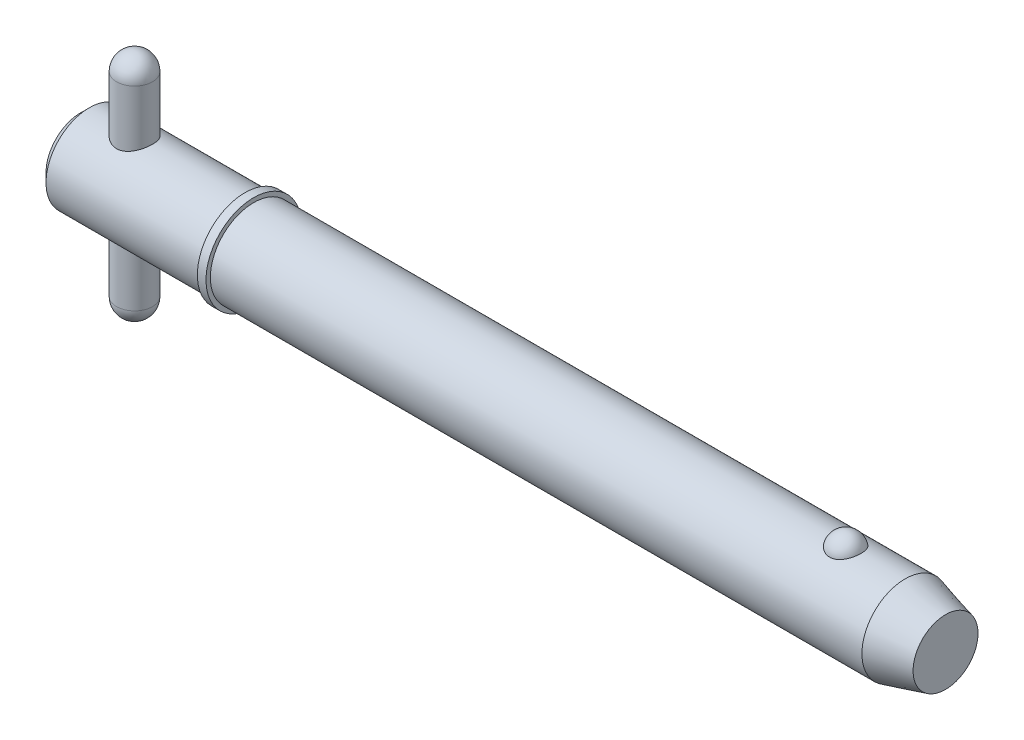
ISO-10303-21;
HEADER;
FILE_DESCRIPTION(('STEP AP214'),'2;1');
FILE_NAME('part.step','',(''),(''),'','','');
FILE_SCHEMA(('AUTOMOTIVE_DESIGN { 1 0 10303 214 1 1 1 1 }'));
ENDSEC;
DATA;
#1=APPLICATION_CONTEXT('core data for automotive mechanical design processes');
#2=APPLICATION_PROTOCOL_DEFINITION('international standard','automotive_design',2000,#1);
#3=PRODUCT_CONTEXT('',#1,'mechanical');
#4=PRODUCT('Part','Part','',(#3));
#5=PRODUCT_RELATED_PRODUCT_CATEGORY('part','',(#4));
#6=PRODUCT_DEFINITION_FORMATION('','',#4);
#7=PRODUCT_DEFINITION_CONTEXT('part definition',#1,'design');
#8=PRODUCT_DEFINITION('design','',#6,#7);
#9=PRODUCT_DEFINITION_SHAPE('','',#8);
#10=(LENGTH_UNIT() NAMED_UNIT(*) SI_UNIT(.MILLI.,.METRE.));
#11=(NAMED_UNIT(*) PLANE_ANGLE_UNIT() SI_UNIT($,.RADIAN.));
#12=(NAMED_UNIT(*) SI_UNIT($,.STERADIAN.) SOLID_ANGLE_UNIT());
#13=UNCERTAINTY_MEASURE_WITH_UNIT(LENGTH_MEASURE(1.E-05),#10,'distance_accuracy_value','');
#14=(GEOMETRIC_REPRESENTATION_CONTEXT(3) GLOBAL_UNCERTAINTY_ASSIGNED_CONTEXT((#13)) GLOBAL_UNIT_ASSIGNED_CONTEXT((#10,
#11,#12)) REPRESENTATION_CONTEXT('',''));
#15=CARTESIAN_POINT('',(0.,0.,0.));
#16=DIRECTION('',(0.,0.,1.));
#17=DIRECTION('',(1.,0.,0.));
#18=AXIS2_PLACEMENT_3D('',#15,#16,#17);
#19=CARTESIAN_POINT('',(5.94,12.7,0.));
#20=DIRECTION('',(0.,-1.,0.));
#21=DIRECTION('',(0.,0.,-1.));
#22=AXIS2_PLACEMENT_3D('',#19,#20,#21);
#23=CYLINDRICAL_SURFACE('',#22,1.98);
#24=CARTESIAN_POINT('',(5.94,-10.72,0.));
#25=DIRECTION('',(0.,-1.,0.));
#26=DIRECTION('',(0.,0.,-1.));
#27=AXIS2_PLACEMENT_3D('',#24,#25,#26);
#28=CIRCLE('',#27,1.98);
#29=CARTESIAN_POINT('',(5.94,-10.72,-1.98));
#30=VERTEX_POINT('',#29);
#31=EDGE_CURVE('P0_E10',#30,#30,#28,.F.);
#32=ORIENTED_EDGE('',*,*,#31,.T.);
#33=EDGE_LOOP('',(#32));
#34=FACE_BOUND('',#33,.T.);
#35=CARTESIAN_POINT('',(5.94,10.72,0.));
#36=DIRECTION('',(0.,-1.,0.));
#37=DIRECTION('',(0.,0.,-1.));
#38=AXIS2_PLACEMENT_3D('',#35,#36,#37);
#39=CIRCLE('',#38,1.98);
#40=CARTESIAN_POINT('',(5.94,10.72,-1.98));
#41=VERTEX_POINT('',#40);
#42=EDGE_CURVE('P0_E21',#41,#41,#39,.T.);
#43=ORIENTED_EDGE('',*,*,#42,.T.);
#44=EDGE_LOOP('',(#43));
#45=FACE_BOUND('',#44,.T.);
#46=ADVANCED_FACE('P0_F14',(#34,#45),#23,.T.);
#47=CARTESIAN_POINT('',(5.94,-10.72,0.));
#48=DIRECTION('',(0.,0.,1.));
#49=DIRECTION('',(1.,0.,0.));
#50=AXIS2_PLACEMENT_3D('',#47,#48,#49);
#51=SPHERICAL_SURFACE('',#50,1.98);
#52=CARTESIAN_POINT('',(5.94,-10.72,0.));
#53=DIRECTION('',(0.,-1.,0.));
#54=DIRECTION('',(0.,0.,-1.));
#55=AXIS2_PLACEMENT_3D('',#52,#53,#54);
#56=SPHERICAL_SURFACE('',#55,1.98);
#57=ORIENTED_EDGE('',*,*,#31,.F.);
#58=EDGE_LOOP('',(#57));
#59=FACE_BOUND('',#58,.T.);
#60=ADVANCED_FACE('P0_F29',(#59),#56,.T.);
#61=CARTESIAN_POINT('',(5.94,10.72,0.));
#62=DIRECTION('',(0.,0.,1.));
#63=DIRECTION('',(1.,0.,0.));
#64=AXIS2_PLACEMENT_3D('',#61,#62,#63);
#65=SPHERICAL_SURFACE('',#64,1.98);
#66=CARTESIAN_POINT('',(5.94,10.72,0.));
#67=DIRECTION('',(0.,-1.,0.));
#68=DIRECTION('',(0.,0.,-1.));
#69=AXIS2_PLACEMENT_3D('',#66,#67,#68);
#70=SPHERICAL_SURFACE('',#69,1.98);
#71=ORIENTED_EDGE('',*,*,#42,.F.);
#72=EDGE_LOOP('',(#71));
#73=FACE_BOUND('',#72,.T.);
#74=ADVANCED_FACE('P0_F16',(#73),#70,.T.);
#75=CLOSED_SHELL('',(#46,#60,#74));
#76=MANIFOLD_SOLID_BREP('P0_B1',#75);
#77=CARTESIAN_POINT('',(0.,0.,0.));
#78=DIRECTION('',(1.,0.,0.));
#79=DIRECTION('',(0.,0.,-1.));
#80=AXIS2_PLACEMENT_3D('',#77,#78,#79);
#81=CYLINDRICAL_SURFACE('',#80,4.765);
#82=CARTESIAN_POINT('',(90.8041944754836,0.,0.));
#83=DIRECTION('',(1.,0.,0.));
#84=DIRECTION('',(0.,0.,-1.));
#85=AXIS2_PLACEMENT_3D('',#82,#83,#84);
#86=CIRCLE('',#85,4.765);
#87=CARTESIAN_POINT('',(90.8041944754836,0.,-4.765));
#88=VERTEX_POINT('',#87);
#89=EDGE_CURVE('P1_E81',#88,#88,#86,.T.);
#90=ORIENTED_EDGE('',*,*,#89,.F.);
#91=EDGE_LOOP('',(#90));
#92=FACE_BOUND('',#91,.T.);
#93=CARTESIAN_POINT('',(19.05,0.,0.));
#94=DIRECTION('',(1.,0.,0.));
#95=DIRECTION('',(0.,0.,-1.));
#96=AXIS2_PLACEMENT_3D('',#93,#94,#95);
#97=CIRCLE('',#96,4.765);
#98=CARTESIAN_POINT('',(19.05,0.,-4.765));
#99=VERTEX_POINT('',#98);
#100=EDGE_CURVE('P1_E85',#99,#99,#97,.T.);
#101=ORIENTED_EDGE('',*,*,#100,.T.);
#102=EDGE_LOOP('',(#101));
#103=FACE_BOUND('',#102,.T.);
#104=CARTESIAN_POINT('',(84.251020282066,4.42764777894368,1.76101111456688));
#105=CARTESIAN_POINT('',(84.1597212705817,4.42764470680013,1.76101422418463));
#106=CARTESIAN_POINT('',(84.0684468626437,4.43059091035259,1.75366340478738));
#107=CARTESIAN_POINT('',(83.8886154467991,4.44201846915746,1.72451180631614));
#108=CARTESIAN_POINT('',(83.8000577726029,4.45049845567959,1.70271460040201));
#109=CARTESIAN_POINT('',(83.6282570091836,4.47200516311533,1.6453937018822));
#110=CARTESIAN_POINT('',(83.5450064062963,4.48502527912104,1.60988994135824));
#111=CARTESIAN_POINT('',(83.3857633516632,4.51419542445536,1.52617873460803));
#112=CARTESIAN_POINT('',(83.3097723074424,4.53034605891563,1.47796883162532));
#113=CARTESIAN_POINT('',(83.1647445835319,4.5645931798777,1.36860494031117));
#114=CARTESIAN_POINT('',(83.0959645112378,4.58273170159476,1.30712420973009));
#115=CARTESIAN_POINT('',(82.9693423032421,4.61870302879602,1.17370204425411));
#116=CARTESIAN_POINT('',(82.9115021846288,4.63653577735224,1.10175868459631));
#117=CARTESIAN_POINT('',(82.8055709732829,4.67090140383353,0.945806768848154));
#118=CARTESIAN_POINT('',(82.7580305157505,4.68734068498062,0.861402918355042));
#119=CARTESIAN_POINT('',(82.6770817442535,4.71628466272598,0.685442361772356));
#120=CARTESIAN_POINT('',(82.6436747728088,4.72878898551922,0.593884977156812));
#121=CARTESIAN_POINT('',(82.591287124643,4.74874061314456,0.404781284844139));
#122=CARTESIAN_POINT('',(82.5725178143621,4.75611366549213,0.307168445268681));
#123=CARTESIAN_POINT('',(82.5505846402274,4.76475393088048,0.109940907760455));
#124=CARTESIAN_POINT('',(82.5474205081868,4.76602124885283,0.0103262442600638));
#125=CARTESIAN_POINT('',(82.5567405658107,4.76232928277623,-0.187629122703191));
#126=CARTESIAN_POINT('',(82.5691588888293,4.7573962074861,-0.285973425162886));
#127=CARTESIAN_POINT('',(82.6092804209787,4.74184975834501,-0.479027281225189));
#128=CARTESIAN_POINT('',(82.6369839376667,4.7312362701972,-0.573736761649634));
#129=CARTESIAN_POINT('',(82.7071581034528,4.70540026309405,-0.756973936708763));
#130=CARTESIAN_POINT('',(82.7496460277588,4.69017235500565,-0.845494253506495));
#131=CARTESIAN_POINT('',(82.848520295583,4.6566986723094,-1.01378033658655));
#132=CARTESIAN_POINT('',(82.9049076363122,4.63845268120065,-1.09354547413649));
#133=CARTESIAN_POINT('',(83.030552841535,4.60085438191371,-1.24228523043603));
#134=CARTESIAN_POINT('',(83.0998439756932,4.58149930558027,-1.31123108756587));
#135=CARTESIAN_POINT('',(83.2496066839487,4.54391653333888,-1.43607409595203));
#136=CARTESIAN_POINT('',(83.3300771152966,4.52568872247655,-1.49197257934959));
#137=CARTESIAN_POINT('',(83.4981500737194,4.49293007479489,-1.58786764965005));
#138=CARTESIAN_POINT('',(83.5855445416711,4.47832346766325,-1.62820219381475));
#139=CARTESIAN_POINT('',(83.766553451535,4.45406011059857,-1.69345757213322));
#140=CARTESIAN_POINT('',(83.8601655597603,4.44440151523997,-1.71838415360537));
#141=CARTESIAN_POINT('',(84.0458939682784,4.43159888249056,-1.75112843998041));
#142=CARTESIAN_POINT('',(84.137849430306,4.42815213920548,-1.75974223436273));
#143=CARTESIAN_POINT('',(84.3219658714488,4.427247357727,-1.76201865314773));
#144=CARTESIAN_POINT('',(84.4141268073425,4.42978816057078,-1.7556841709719));
#145=CARTESIAN_POINT('',(84.5931292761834,4.4403864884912,-1.72869560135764));
#146=CARTESIAN_POINT('',(84.6800474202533,4.44827555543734,-1.70847853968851));
#147=CARTESIAN_POINT('',(84.8491314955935,4.46852246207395,-1.65479562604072));
#148=CARTESIAN_POINT('',(84.9312970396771,4.48088066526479,-1.62132869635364));
#149=CARTESIAN_POINT('',(85.0905916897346,4.50907357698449,-1.54120560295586));
#150=CARTESIAN_POINT('',(85.1675700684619,4.52497884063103,-1.49427526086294));
#151=CARTESIAN_POINT('',(85.3127080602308,4.55845148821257,-1.38881222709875));
#152=CARTESIAN_POINT('',(85.3808656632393,4.57601924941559,-1.33027689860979));
#153=CARTESIAN_POINT('',(85.5100990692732,4.61196537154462,-1.19991049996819));
#154=CARTESIAN_POINT('',(85.5706562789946,4.63034074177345,-1.12756415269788));
#155=CARTESIAN_POINT('',(85.6792797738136,4.66513959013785,-0.973612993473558));
#156=CARTESIAN_POINT('',(85.7273438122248,4.68156271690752,-0.892006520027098));
#157=CARTESIAN_POINT('',(85.811383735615,4.71130224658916,-0.718892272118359));
#158=CARTESIAN_POINT('',(85.8469185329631,4.724501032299,-0.627149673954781));
#159=CARTESIAN_POINT('',(85.9029522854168,4.74571823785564,-0.438611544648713));
#160=CARTESIAN_POINT('',(85.923450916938,4.75373654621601,-0.341815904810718));
#161=CARTESIAN_POINT('',(85.9490338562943,4.76378905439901,-0.145633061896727));
#162=CARTESIAN_POINT('',(85.954076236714,4.76580697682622,-0.0462395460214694));
#163=CARTESIAN_POINT('',(85.9485239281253,4.76360573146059,0.152038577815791));
#164=CARTESIAN_POINT('',(85.9379294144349,4.75938663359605,0.250923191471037));
#165=CARTESIAN_POINT('',(85.9013875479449,4.74516937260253,0.445004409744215));
#166=CARTESIAN_POINT('',(85.8754964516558,4.73519238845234,0.540213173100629));
#167=CARTESIAN_POINT('',(85.8089273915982,4.7104939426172,0.724662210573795));
#168=CARTESIAN_POINT('',(85.768248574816,4.69577220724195,0.813902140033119));
#169=CARTESIAN_POINT('',(85.6727177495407,4.66303767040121,0.984313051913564));
#170=CARTESIAN_POINT('',(85.6178042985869,4.64501070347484,1.06544688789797));
#171=CARTESIAN_POINT('',(85.4950496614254,4.60764678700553,1.21692673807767));
#172=CARTESIAN_POINT('',(85.4272086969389,4.58830985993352,1.2872729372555));
#173=CARTESIAN_POINT('',(85.2805480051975,4.55060370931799,1.41479271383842));
#174=CARTESIAN_POINT('',(85.2017918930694,4.53222967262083,1.4720378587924));
#175=CARTESIAN_POINT('',(85.0349890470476,4.49849576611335,1.57212016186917));
#176=CARTESIAN_POINT('',(84.9469417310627,4.48313608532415,1.61495641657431));
#177=CARTESIAN_POINT('',(84.7597918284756,4.45676184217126,1.68642657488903));
#178=CARTESIAN_POINT('',(84.6603653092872,4.44598302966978,1.71430590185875));
#179=CARTESIAN_POINT('',(84.4576210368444,4.43142918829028,1.75159258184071));
#180=CARTESIAN_POINT('',(84.3543049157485,4.42765125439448,1.76100759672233));
#181=CARTESIAN_POINT('',(84.251020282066,4.42764777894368,1.76101111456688));
#182=B_SPLINE_CURVE_WITH_KNOTS('',3,(#104,#105,#106,#107,#108,#109,#110,#111,#112,#113,#114,
#115,#116,#117,#118,#119,#120,#121,#122,#123,#124,#125,#126,#127,#128,#129,#130,#131,#132,#133,
#134,#135,#136,#137,#138,#139,#140,#141,#142,#143,#144,#145,#146,#147,#148,#149,#150,#151,#152,
#153,#154,#155,#156,#157,#158,#159,#160,#161,#162,#163,#164,#165,#166,#167,#168,#169,#170,#171,
#172,#173,#174,#175,#176,#177,#178,#179,#180,#181),.UNSPECIFIED.,.T.,.F.,(4,2,2,2,2,2,2,2,2,2,2,
2,2,2,2,2,2,2,2,2,2,2,2,2,2,2,2,2,2,2,2,2,2,2,2,2,2,2,4),(0.,0.273517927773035,
0.546968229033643,0.820022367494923,1.09312934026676,1.37393946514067,1.65480131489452,
1.94820420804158,2.24163496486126,2.53922817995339,2.8368162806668,3.13315071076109,
3.42949110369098,3.72617893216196,4.02288805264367,4.32037303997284,4.61782764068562,
4.90840095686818,5.19886582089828,5.4747485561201,5.75057789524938,6.01809977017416,
6.2856434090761,6.55907787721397,6.83257454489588,7.11962987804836,7.40673679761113,
7.70312663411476,7.99952284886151,8.29672237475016,8.59391856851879,8.89002850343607,
9.18615552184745,9.483582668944,9.78100471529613,10.0767610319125,10.3725358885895,
10.6820893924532,10.991514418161),.UNSPECIFIED.);
#183=CARTESIAN_POINT('',(84.251020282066,4.42764777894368,1.76101111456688));
#184=VERTEX_POINT('',#183);
#185=EDGE_CURVE('P1_E35',#184,#184,#182,.T.);
#186=ORIENTED_EDGE('',*,*,#185,.T.);
#187=EDGE_LOOP('',(#186));
#188=FACE_BOUND('',#187,.T.);
#189=ADVANCED_FACE('P1_F13',(#92,#103,#188),#81,.T.);
#190=CARTESIAN_POINT('',(0.,0.,0.));
#191=DIRECTION('',(-1.,0.,0.));
#192=DIRECTION('',(0.,0.,1.));
#193=AXIS2_PLACEMENT_3D('',#190,#191,#192);
#194=PLANE('',#193);
#195=CARTESIAN_POINT('',(0.,0.,0.));
#196=DIRECTION('',(1.,0.,0.));
#197=DIRECTION('',(0.,0.,-1.));
#198=AXIS2_PLACEMENT_3D('',#195,#196,#197);
#199=CIRCLE('',#198,3.812);
#200=CARTESIAN_POINT('',(0.,0.,-3.812));
#201=VERTEX_POINT('',#200);
#202=EDGE_CURVE('P1_E9',#201,#201,#199,.T.);
#203=ORIENTED_EDGE('',*,*,#202,.F.);
#204=EDGE_LOOP('',(#203));
#205=FACE_BOUND('',#204,.T.);
#206=ADVANCED_FACE('P1_F15',(#205),#194,.T.);
#207=CARTESIAN_POINT('',(0.952999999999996,0.,0.));
#208=DIRECTION('',(1.,0.,0.));
#209=DIRECTION('',(0.,0.,-1.));
#210=AXIS2_PLACEMENT_3D('',#207,#208,#209);
#211=CONICAL_SURFACE('',#210,4.765,0.78539816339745);
#212=ORIENTED_EDGE('',*,*,#202,.T.);
#213=EDGE_LOOP('',(#212));
#214=FACE_BOUND('',#213,.T.);
#215=CARTESIAN_POINT('',(0.952999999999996,0.,0.));
#216=DIRECTION('',(1.,0.,0.));
#217=DIRECTION('',(0.,0.,-1.));
#218=AXIS2_PLACEMENT_3D('',#215,#216,#217);
#219=CIRCLE('',#218,4.765);
#220=CARTESIAN_POINT('',(0.952999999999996,0.,-4.765));
#221=VERTEX_POINT('',#220);
#222=EDGE_CURVE('P1_E26',#221,#221,#219,.T.);
#223=ORIENTED_EDGE('',*,*,#222,.F.);
#224=EDGE_LOOP('',(#223));
#225=FACE_BOUND('',#224,.T.);
#226=ADVANCED_FACE('P1_F77',(#214,#225),#211,.T.);
#227=CARTESIAN_POINT('',(0.,0.,0.));
#228=DIRECTION('',(1.,0.,0.));
#229=DIRECTION('',(0.,0.,-1.));
#230=AXIS2_PLACEMENT_3D('',#227,#228,#229);
#231=CYLINDRICAL_SURFACE('',#230,4.765);
#232=CARTESIAN_POINT('',(5.94,-4.33414639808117,1.98));
#233=CARTESIAN_POINT('',(5.83435484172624,-4.33415447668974,1.97999169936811));
#234=CARTESIAN_POINT('',(5.72854887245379,-4.33806396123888,1.97149330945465));
#235=CARTESIAN_POINT('',(5.51998191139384,-4.35319906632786,1.93783487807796));
#236=CARTESIAN_POINT('',(5.41723000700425,-4.3644446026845,1.91262947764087));
#237=CARTESIAN_POINT('',(5.21817294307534,-4.39274225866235,1.84670269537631));
#238=CARTESIAN_POINT('',(5.12184344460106,-4.40977076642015,1.80604432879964));
#239=CARTESIAN_POINT('',(4.93740039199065,-4.44768106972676,1.71055160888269));
#240=CARTESIAN_POINT('',(4.84928487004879,-4.46856193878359,1.65572066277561));
#241=CARTESIAN_POINT('',(4.67826533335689,-4.51326966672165,1.52981120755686));
#242=CARTESIAN_POINT('',(4.59593118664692,-4.53719608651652,1.45799365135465));
#243=CARTESIAN_POINT('',(4.44405452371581,-4.58448035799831,1.30170177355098));
#244=CARTESIAN_POINT('',(4.37451692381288,-4.60783798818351,1.21722260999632));
#245=CARTESIAN_POINT('',(4.24730683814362,-4.65256187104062,1.03353484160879));
#246=CARTESIAN_POINT('',(4.19027484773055,-4.67379892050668,0.933848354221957));
#247=CARTESIAN_POINT('',(4.0940363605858,-4.7106711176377,0.7252544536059));
#248=CARTESIAN_POINT('',(4.05482199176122,-4.72630873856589,0.61635113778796));
#249=CARTESIAN_POINT('',(3.99739515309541,-4.74951416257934,0.398397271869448));
#250=CARTESIAN_POINT('',(3.97820018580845,-4.7574579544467,0.289646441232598));
#251=CARTESIAN_POINT('',(3.95818309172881,-4.76574596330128,0.0701967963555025));
#252=CARTESIAN_POINT('',(3.95735355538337,-4.76609324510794,-0.0405012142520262));
#253=CARTESIAN_POINT('',(3.9735743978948,-4.75937098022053,-0.253561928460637));
#254=CARTESIAN_POINT('',(3.98954548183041,-4.75274912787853,-0.356023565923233));
#255=CARTESIAN_POINT('',(4.03706504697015,-4.73344665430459,-0.556659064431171));
#256=CARTESIAN_POINT('',(4.06861467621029,-4.72076558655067,-0.654832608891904));
#257=CARTESIAN_POINT('',(4.14677192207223,-4.69032846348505,-0.845904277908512));
#258=CARTESIAN_POINT('',(4.19360181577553,-4.67249797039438,-0.938699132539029));
#259=CARTESIAN_POINT('',(4.30077315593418,-4.63350852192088,-1.11535616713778));
#260=CARTESIAN_POINT('',(4.3611193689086,-4.61234839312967,-1.19921518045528));
#261=CARTESIAN_POINT('',(4.49853487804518,-4.56707259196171,-1.3618711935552));
#262=CARTESIAN_POINT('',(4.57648039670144,-4.5428537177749,-1.43990029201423));
#263=CARTESIAN_POINT('',(4.74440779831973,-4.49530722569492,-1.58211009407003));
#264=CARTESIAN_POINT('',(4.83439425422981,-4.47197995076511,-1.64628551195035));
#265=CARTESIAN_POINT('',(5.02755026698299,-4.42812342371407,-1.76092221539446));
#266=CARTESIAN_POINT('',(5.13105348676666,-4.40770990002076,-1.81086937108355));
#267=CARTESIAN_POINT('',(5.34607555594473,-4.37336901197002,-1.89231211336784));
#268=CARTESIAN_POINT('',(5.45758864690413,-4.3594370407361,-1.92382080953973));
#269=CARTESIAN_POINT('',(5.67777275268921,-4.34077746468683,-1.96554536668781));
#270=CARTESIAN_POINT('',(5.78616167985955,-4.33551319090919,-1.9770057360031));
#271=CARTESIAN_POINT('',(6.00341835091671,-4.33325118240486,-1.98196183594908));
#272=CARTESIAN_POINT('',(6.11228591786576,-4.33625061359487,-1.97546372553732));
#273=CARTESIAN_POINT('',(6.32012423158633,-4.34962383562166,-1.94582288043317));
#274=CARTESIAN_POINT('',(6.41928436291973,-4.35951709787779,-1.92376364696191));
#275=CARTESIAN_POINT('',(6.61241543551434,-4.38495043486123,-1.86506038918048));
#276=CARTESIAN_POINT('',(6.70638516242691,-4.40049182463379,-1.82841296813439));
#277=CARTESIAN_POINT('',(6.89090272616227,-4.43627016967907,-1.73985559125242));
#278=CARTESIAN_POINT('',(6.98113841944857,-4.45667771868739,-1.68736639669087));
#279=CARTESIAN_POINT('',(7.1519532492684,-4.49964530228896,-1.56919282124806));
#280=CARTESIAN_POINT('',(7.232528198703,-4.52220626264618,-1.50350275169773));
#281=CARTESIAN_POINT('',(7.38851617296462,-4.56914071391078,-1.35452895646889));
#282=CARTESIAN_POINT('',(7.46298462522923,-4.5935132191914,-1.27025197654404));
#283=CARTESIAN_POINT('',(7.59689029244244,-4.63962841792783,-1.08983181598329));
#284=CARTESIAN_POINT('',(7.65632644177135,-4.66137092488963,-0.993687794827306));
#285=CARTESIAN_POINT('',(7.75840361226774,-4.69991192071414,-0.791608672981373));
#286=CARTESIAN_POINT('',(7.80100481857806,-4.71669866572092,-0.685651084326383));
#287=CARTESIAN_POINT('',(7.86746997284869,-4.74331408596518,-0.467197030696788));
#288=CARTESIAN_POINT('',(7.8913450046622,-4.75314687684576,-0.354704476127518));
#289=CARTESIAN_POINT('',(7.91828971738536,-4.76427543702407,-0.134819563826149));
#290=CARTESIAN_POINT('',(7.92269147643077,-4.76611762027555,-0.027616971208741));
#291=CARTESIAN_POINT('',(7.91414154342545,-4.76256684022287,0.185959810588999));
#292=CARTESIAN_POINT('',(7.90119286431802,-4.75717513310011,0.292334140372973));
#293=CARTESIAN_POINT('',(7.85926572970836,-4.74004856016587,0.497383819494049));
#294=CARTESIAN_POINT('',(7.83086647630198,-4.72854322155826,0.596198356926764));
#295=CARTESIAN_POINT('',(7.75947503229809,-4.70045111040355,0.787624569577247));
#296=CARTESIAN_POINT('',(7.71648006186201,-4.68386336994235,0.880235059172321));
#297=CARTESIAN_POINT('',(7.6149456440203,-4.64628321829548,1.06122875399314));
#298=CARTESIAN_POINT('',(7.55579211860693,-4.62512577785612,1.14923242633));
#299=CARTESIAN_POINT('',(7.42451813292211,-4.58091700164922,1.31443888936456));
#300=CARTESIAN_POINT('',(7.35239289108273,-4.5578649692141,1.39163767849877));
#301=CARTESIAN_POINT('',(7.19146107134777,-4.51050832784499,1.53847013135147));
#302=CARTESIAN_POINT('',(7.10185635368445,-4.48622440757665,1.60723941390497));
#303=CARTESIAN_POINT('',(6.91164948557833,-4.44076541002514,1.72888900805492));
#304=CARTESIAN_POINT('',(6.81104124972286,-4.41959206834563,1.78176046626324));
#305=CARTESIAN_POINT('',(6.60181953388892,-4.38318936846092,1.86953227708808));
#306=CARTESIAN_POINT('',(6.49325511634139,-4.3679267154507,1.90453365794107));
#307=CARTESIAN_POINT('',(6.32681512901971,-4.35102038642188,1.94268459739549));
#308=CARTESIAN_POINT('',(6.27079191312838,-4.34638447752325,1.953006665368));
#309=CARTESIAN_POINT('',(6.15793999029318,-4.33925923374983,1.96879053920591));
#310=CARTESIAN_POINT('',(6.10111188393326,-4.33676837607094,1.97425579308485));
#311=CARTESIAN_POINT('',(6.00947316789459,-4.33456308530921,1.97908711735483));
#312=CARTESIAN_POINT('',(5.97474528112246,-4.33414374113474,1.98000272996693));
#313=CARTESIAN_POINT('',(5.94,-4.33414639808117,1.98));
#314=B_SPLINE_CURVE_WITH_KNOTS('',3,(#232,#233,#234,#235,#236,#237,#238,#239,#240,#241,#242,
#243,#244,#245,#246,#247,#248,#249,#250,#251,#252,#253,#254,#255,#256,#257,#258,#259,#260,#261,
#262,#263,#264,#265,#266,#267,#268,#269,#270,#271,#272,#273,#274,#275,#276,#277,#278,#279,#280,
#281,#282,#283,#284,#285,#286,#287,#288,#289,#290,#291,#292,#293,#294,#295,#296,#297,#298,#299,
#300,#301,#302,#303,#304,#305,#306,#307,#308,#309,#310,#311,#312,#313),.UNSPECIFIED.,.T.,.F.,(4,
2,2,2,2,2,2,2,2,2,2,2,2,2,2,2,2,2,2,2,2,2,2,2,2,2,2,2,2,2,2,2,2,2,2,2,2,2,2,2,4),(0.,
0.316814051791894,0.634491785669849,0.950887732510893,1.2672076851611,1.60127705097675,
1.93547449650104,2.28407463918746,2.63252061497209,2.96292077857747,3.29318763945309,
3.60346227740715,3.91375978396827,4.22878888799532,4.54392926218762,4.88117914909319,
5.21855748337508,5.56691259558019,5.91501972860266,6.24062939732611,6.56612741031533,
6.87094948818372,7.17584258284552,7.49361276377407,7.81152017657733,8.15513975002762,
8.4987836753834,8.8432355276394,9.18748334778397,9.50777781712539,9.8280166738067,
10.1370037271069,10.4460496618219,10.7690461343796,11.0921619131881,11.4371238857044,
11.7822776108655,12.1254577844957,12.2967183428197,12.4678572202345,12.5720531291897),.UNSPECIFIED.);
#315=CARTESIAN_POINT('',(5.94,-4.33414639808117,1.98));
#316=VERTEX_POINT('',#315);
#317=EDGE_CURVE('P1_E17',#316,#316,#314,.T.);
#318=ORIENTED_EDGE('',*,*,#317,.F.);
#319=EDGE_LOOP('',(#318));
#320=FACE_BOUND('',#319,.T.);
#321=CARTESIAN_POINT('',(5.94,4.33414639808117,1.98));
#322=CARTESIAN_POINT('',(6.04564515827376,4.33415447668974,1.97999169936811));
#323=CARTESIAN_POINT('',(6.15145112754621,4.33806396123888,1.97149330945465));
#324=CARTESIAN_POINT('',(6.36001808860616,4.35319906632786,1.93783487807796));
#325=CARTESIAN_POINT('',(6.46276999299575,4.3644446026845,1.91262947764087));
#326=CARTESIAN_POINT('',(6.66182705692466,4.39274225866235,1.84670269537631));
#327=CARTESIAN_POINT('',(6.75815655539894,4.40977076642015,1.80604432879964));
#328=CARTESIAN_POINT('',(6.94259960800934,4.44768106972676,1.71055160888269));
#329=CARTESIAN_POINT('',(7.03071512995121,4.46856193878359,1.65572066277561));
#330=CARTESIAN_POINT('',(7.20173466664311,4.51326966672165,1.52981120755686));
#331=CARTESIAN_POINT('',(7.28406881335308,4.53719608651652,1.45799365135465));
#332=CARTESIAN_POINT('',(7.43594547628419,4.58448035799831,1.30170177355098));
#333=CARTESIAN_POINT('',(7.50548307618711,4.60783798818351,1.21722260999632));
#334=CARTESIAN_POINT('',(7.63269316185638,4.65256187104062,1.03353484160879));
#335=CARTESIAN_POINT('',(7.68972515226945,4.67379892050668,0.933848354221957));
#336=CARTESIAN_POINT('',(7.7859636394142,4.7106711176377,0.7252544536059));
#337=CARTESIAN_POINT('',(7.82517800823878,4.72630873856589,0.61635113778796));
#338=CARTESIAN_POINT('',(7.88260484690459,4.74951416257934,0.398397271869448));
#339=CARTESIAN_POINT('',(7.90179981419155,4.7574579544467,0.289646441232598));
#340=CARTESIAN_POINT('',(7.92181690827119,4.76574596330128,0.0701967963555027));
#341=CARTESIAN_POINT('',(7.92264644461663,4.76609324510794,-0.040501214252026));
#342=CARTESIAN_POINT('',(7.9064256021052,4.75937098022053,-0.253561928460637));
#343=CARTESIAN_POINT('',(7.89045451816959,4.75274912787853,-0.356023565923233));
#344=CARTESIAN_POINT('',(7.84293495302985,4.73344665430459,-0.55665906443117));
#345=CARTESIAN_POINT('',(7.81138532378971,4.72076558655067,-0.654832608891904));
#346=CARTESIAN_POINT('',(7.73322807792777,4.69032846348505,-0.845904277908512));
#347=CARTESIAN_POINT('',(7.68639818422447,4.67249797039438,-0.938699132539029));
#348=CARTESIAN_POINT('',(7.57922684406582,4.63350852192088,-1.11535616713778));
#349=CARTESIAN_POINT('',(7.5188806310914,4.61234839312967,-1.19921518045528));
#350=CARTESIAN_POINT('',(7.38146512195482,4.56707259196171,-1.3618711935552));
#351=CARTESIAN_POINT('',(7.30351960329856,4.5428537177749,-1.43990029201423));
#352=CARTESIAN_POINT('',(7.13559220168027,4.49530722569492,-1.58211009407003));
#353=CARTESIAN_POINT('',(7.04560574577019,4.47197995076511,-1.64628551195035));
#354=CARTESIAN_POINT('',(6.85244973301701,4.42812342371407,-1.76092221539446));
#355=CARTESIAN_POINT('',(6.74894651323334,4.40770990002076,-1.81086937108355));
#356=CARTESIAN_POINT('',(6.53392444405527,4.37336901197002,-1.89231211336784));
#357=CARTESIAN_POINT('',(6.42241135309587,4.3594370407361,-1.92382080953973));
#358=CARTESIAN_POINT('',(6.20222724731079,4.34077746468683,-1.96554536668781));
#359=CARTESIAN_POINT('',(6.09383832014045,4.33551319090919,-1.9770057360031));
#360=CARTESIAN_POINT('',(5.87658164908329,4.33325118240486,-1.98196183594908));
#361=CARTESIAN_POINT('',(5.76771408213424,4.33625061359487,-1.97546372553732));
#362=CARTESIAN_POINT('',(5.55987576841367,4.34962383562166,-1.94582288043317));
#363=CARTESIAN_POINT('',(5.46071563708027,4.35951709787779,-1.92376364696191));
#364=CARTESIAN_POINT('',(5.26758456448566,4.38495043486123,-1.86506038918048));
#365=CARTESIAN_POINT('',(5.17361483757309,4.40049182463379,-1.82841296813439));
#366=CARTESIAN_POINT('',(4.98909727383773,4.43627016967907,-1.73985559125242));
#367=CARTESIAN_POINT('',(4.89886158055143,4.45667771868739,-1.68736639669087));
#368=CARTESIAN_POINT('',(4.72804675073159,4.49964530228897,-1.56919282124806));
#369=CARTESIAN_POINT('',(4.647471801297,4.52220626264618,-1.50350275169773));
#370=CARTESIAN_POINT('',(4.49148382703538,4.56914071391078,-1.35452895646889));
#371=CARTESIAN_POINT('',(4.41701537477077,4.5935132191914,-1.27025197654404));
#372=CARTESIAN_POINT('',(4.28310970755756,4.63962841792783,-1.08983181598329));
#373=CARTESIAN_POINT('',(4.22367355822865,4.66137092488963,-0.993687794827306));
#374=CARTESIAN_POINT('',(4.12159638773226,4.69991192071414,-0.791608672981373));
#375=CARTESIAN_POINT('',(4.07899518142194,4.71669866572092,-0.685651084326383));
#376=CARTESIAN_POINT('',(4.01253002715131,4.74331408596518,-0.467197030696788));
#377=CARTESIAN_POINT('',(3.98865499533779,4.75314687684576,-0.354704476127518));
#378=CARTESIAN_POINT('',(3.96171028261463,4.76427543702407,-0.134819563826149));
#379=CARTESIAN_POINT('',(3.95730852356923,4.76611762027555,-0.0276169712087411));
#380=CARTESIAN_POINT('',(3.96585845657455,4.76256684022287,0.185959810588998));
#381=CARTESIAN_POINT('',(3.97880713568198,4.75717513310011,0.292334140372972));
#382=CARTESIAN_POINT('',(4.02073427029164,4.74004856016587,0.497383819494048));
#383=CARTESIAN_POINT('',(4.04913352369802,4.72854322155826,0.596198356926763));
#384=CARTESIAN_POINT('',(4.12052496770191,4.70045111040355,0.787624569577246));
#385=CARTESIAN_POINT('',(4.16351993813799,4.68386336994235,0.880235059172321));
#386=CARTESIAN_POINT('',(4.2650543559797,4.64628321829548,1.06122875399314));
#387=CARTESIAN_POINT('',(4.32420788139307,4.62512577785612,1.14923242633));
#388=CARTESIAN_POINT('',(4.45548186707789,4.58091700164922,1.31443888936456));
#389=CARTESIAN_POINT('',(4.52760710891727,4.5578649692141,1.39163767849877));
#390=CARTESIAN_POINT('',(4.68853892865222,4.51050832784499,1.53847013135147));
#391=CARTESIAN_POINT('',(4.77814364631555,4.48622440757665,1.60723941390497));
#392=CARTESIAN_POINT('',(4.96835051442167,4.44076541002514,1.72888900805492));
#393=CARTESIAN_POINT('',(5.06895875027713,4.41959206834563,1.78176046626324));
#394=CARTESIAN_POINT('',(5.27818046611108,4.38318936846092,1.86953227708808));
#395=CARTESIAN_POINT('',(5.38674488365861,4.3679267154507,1.90453365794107));
#396=CARTESIAN_POINT('',(5.55318487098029,4.35102038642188,1.94268459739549));
#397=CARTESIAN_POINT('',(5.60920808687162,4.34638447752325,1.953006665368));
#398=CARTESIAN_POINT('',(5.72206000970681,4.33925923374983,1.96879053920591));
#399=CARTESIAN_POINT('',(5.77888811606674,4.33676837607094,1.97425579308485));
#400=CARTESIAN_POINT('',(5.87052683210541,4.33456308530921,1.97908711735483));
#401=CARTESIAN_POINT('',(5.90525471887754,4.33414374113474,1.98000272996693));
#402=CARTESIAN_POINT('',(5.94,4.33414639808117,1.98));
#403=B_SPLINE_CURVE_WITH_KNOTS('',3,(#321,#322,#323,#324,#325,#326,#327,#328,#329,#330,#331,
#332,#333,#334,#335,#336,#337,#338,#339,#340,#341,#342,#343,#344,#345,#346,#347,#348,#349,#350,
#351,#352,#353,#354,#355,#356,#357,#358,#359,#360,#361,#362,#363,#364,#365,#366,#367,#368,#369,
#370,#371,#372,#373,#374,#375,#376,#377,#378,#379,#380,#381,#382,#383,#384,#385,#386,#387,#388,
#389,#390,#391,#392,#393,#394,#395,#396,#397,#398,#399,#400,#401,#402),.UNSPECIFIED.,.T.,.F.,(4,
2,2,2,2,2,2,2,2,2,2,2,2,2,2,2,2,2,2,2,2,2,2,2,2,2,2,2,2,2,2,2,2,2,2,2,2,2,2,2,4),(0.,
0.316814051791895,0.634491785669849,0.950887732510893,1.2672076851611,1.60127705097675,
1.93547449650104,2.28407463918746,2.63252061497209,2.96292077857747,3.29318763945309,
3.60346227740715,3.91375978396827,4.22878888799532,4.54392926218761,4.88117914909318,
5.21855748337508,5.56691259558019,5.91501972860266,6.24062939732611,6.56612741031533,
6.87094948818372,7.17584258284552,7.49361276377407,7.81152017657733,8.15513975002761,
8.4987836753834,8.84323552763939,9.18748334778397,9.50777781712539,9.8280166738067,
10.1370037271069,10.4460496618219,10.7690461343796,11.0921619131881,11.4371238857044,
11.7822776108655,12.1254577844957,12.2967183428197,12.4678572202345,12.5720531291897),.UNSPECIFIED.);
#404=CARTESIAN_POINT('',(5.94,4.33414639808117,1.98));
#405=VERTEX_POINT('',#404);
#406=EDGE_CURVE('P1_E43',#405,#405,#403,.T.);
#407=ORIENTED_EDGE('',*,*,#406,.F.);
#408=EDGE_LOOP('',(#407));
#409=FACE_BOUND('',#408,.T.);
#410=ORIENTED_EDGE('',*,*,#222,.T.);
#411=EDGE_LOOP('',(#410));
#412=FACE_BOUND('',#411,.T.);
#413=CARTESIAN_POINT('',(18.097,0.,0.));
#414=DIRECTION('',(1.,0.,0.));
#415=DIRECTION('',(0.,0.,-1.));
#416=AXIS2_PLACEMENT_3D('',#413,#414,#415);
#417=CIRCLE('',#416,4.765);
#418=CARTESIAN_POINT('',(18.097,0.,-4.765));
#419=VERTEX_POINT('',#418);
#420=EDGE_CURVE('P1_E31',#419,#419,#417,.T.);
#421=ORIENTED_EDGE('',*,*,#420,.F.);
#422=EDGE_LOOP('',(#421));
#423=FACE_BOUND('',#422,.T.);
#424=ADVANCED_FACE('P1_F103',(#320,#409,#412,#423),#231,.T.);
#425=CARTESIAN_POINT('',(18.097,4.765,0.));
#426=DIRECTION('',(-1.,0.,0.));
#427=DIRECTION('',(0.,0.,1.));
#428=AXIS2_PLACEMENT_3D('',#425,#426,#427);
#429=PLANE('',#428);
#430=ORIENTED_EDGE('',*,*,#420,.T.);
#431=EDGE_LOOP('',(#430));
#432=FACE_BOUND('',#431,.T.);
#433=CARTESIAN_POINT('',(18.097,0.,0.));
#434=DIRECTION('',(1.,0.,0.));
#435=DIRECTION('',(0.,0.,-1.));
#436=AXIS2_PLACEMENT_3D('',#433,#434,#435);
#437=CIRCLE('',#436,5.2415);
#438=CARTESIAN_POINT('',(18.097,0.,-5.2415));
#439=VERTEX_POINT('',#438);
#440=EDGE_CURVE('P1_E91',#439,#439,#437,.T.);
#441=ORIENTED_EDGE('',*,*,#440,.F.);
#442=EDGE_LOOP('',(#441));
#443=FACE_BOUND('',#442,.T.);
#444=ADVANCED_FACE('P1_F100',(#432,#443),#429,.T.);
#445=CARTESIAN_POINT('',(0.,0.,0.));
#446=DIRECTION('',(1.,0.,0.));
#447=DIRECTION('',(0.,0.,-1.));
#448=AXIS2_PLACEMENT_3D('',#445,#446,#447);
#449=CYLINDRICAL_SURFACE('',#448,5.2415);
#450=ORIENTED_EDGE('',*,*,#440,.T.);
#451=EDGE_LOOP('',(#450));
#452=FACE_BOUND('',#451,.T.);
#453=CARTESIAN_POINT('',(19.05,0.,0.));
#454=DIRECTION('',(1.,0.,0.));
#455=DIRECTION('',(0.,0.,-1.));
#456=AXIS2_PLACEMENT_3D('',#453,#454,#455);
#457=CIRCLE('',#456,5.2415);
#458=CARTESIAN_POINT('',(19.05,0.,-5.2415));
#459=VERTEX_POINT('',#458);
#460=EDGE_CURVE('P1_E88',#459,#459,#457,.T.);
#461=ORIENTED_EDGE('',*,*,#460,.F.);
#462=EDGE_LOOP('',(#461));
#463=FACE_BOUND('',#462,.T.);
#464=ADVANCED_FACE('P1_F68',(#452,#463),#449,.T.);
#465=CARTESIAN_POINT('',(19.05,5.2415,0.));
#466=DIRECTION('',(1.,0.,0.));
#467=DIRECTION('',(0.,0.,-1.));
#468=AXIS2_PLACEMENT_3D('',#465,#466,#467);
#469=PLANE('',#468);
#470=ORIENTED_EDGE('',*,*,#460,.T.);
#471=EDGE_LOOP('',(#470));
#472=FACE_BOUND('',#471,.T.);
#473=ORIENTED_EDGE('',*,*,#100,.F.);
#474=EDGE_LOOP('',(#473));
#475=FACE_BOUND('',#474,.T.);
#476=ADVANCED_FACE('P1_F62',(#472,#475),#469,.T.);
#477=CARTESIAN_POINT('',(95.25,0.,0.));
#478=DIRECTION('',(-1.,0.,0.));
#479=DIRECTION('',(0.,0.,1.));
#480=AXIS2_PLACEMENT_3D('',#477,#478,#479);
#481=CONICAL_SURFACE('',#480,3.57375000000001,0.261799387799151);
#482=ORIENTED_EDGE('',*,*,#89,.T.);
#483=EDGE_LOOP('',(#482));
#484=FACE_BOUND('',#483,.T.);
#485=CARTESIAN_POINT('',(95.25,0.,0.));
#486=DIRECTION('',(1.,0.,0.));
#487=DIRECTION('',(0.,0.,-1.));
#488=AXIS2_PLACEMENT_3D('',#485,#486,#487);
#489=CIRCLE('',#488,3.57375000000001);
#490=CARTESIAN_POINT('',(95.25,0.,-3.57375000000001));
#491=VERTEX_POINT('',#490);
#492=EDGE_CURVE('P1_E42',#491,#491,#489,.T.);
#493=ORIENTED_EDGE('',*,*,#492,.F.);
#494=EDGE_LOOP('',(#493));
#495=FACE_BOUND('',#494,.T.);
#496=ADVANCED_FACE('P1_F59',(#484,#495),#481,.T.);
#497=CARTESIAN_POINT('',(95.25,3.57375000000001,0.));
#498=DIRECTION('',(1.,0.,0.));
#499=DIRECTION('',(0.,0.,-1.));
#500=AXIS2_PLACEMENT_3D('',#497,#498,#499);
#501=PLANE('',#500);
#502=ORIENTED_EDGE('',*,*,#492,.T.);
#503=EDGE_LOOP('',(#502));
#504=FACE_BOUND('',#503,.T.);
#505=ADVANCED_FACE('P1_F55',(#504),#501,.T.);
#506=CARTESIAN_POINT('',(84.251020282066,4.2885,0.));
#507=DIRECTION('',(-1.,0.,0.));
#508=DIRECTION('',(0.,1.,0.));
#509=AXIS2_PLACEMENT_3D('',#506,#507,#508);
#510=SPHERICAL_SURFACE('',#509,1.7665);
#511=ORIENTED_EDGE('',*,*,#185,.F.);
#512=EDGE_LOOP('',(#511));
#513=FACE_BOUND('',#512,.T.);
#514=ADVANCED_FACE('P1_F50',(#513),#510,.T.);
#515=CARTESIAN_POINT('',(5.94,-5.2415,0.));
#516=DIRECTION('',(0.,1.,0.));
#517=DIRECTION('',(0.,0.,1.));
#518=AXIS2_PLACEMENT_3D('',#515,#516,#517);
#519=CYLINDRICAL_SURFACE('',#518,1.98);
#520=ORIENTED_EDGE('',*,*,#317,.T.);
#521=EDGE_LOOP('',(#520));
#522=FACE_BOUND('',#521,.T.);
#523=ORIENTED_EDGE('',*,*,#406,.T.);
#524=EDGE_LOOP('',(#523));
#525=FACE_BOUND('',#524,.T.);
#526=ADVANCED_FACE('P1_F54',(#522,#525),#519,.F.);
#527=CLOSED_SHELL('',(#189,#206,#226,#424,#444,#464,#476,#496,#505,#514,#526));
#528=MANIFOLD_SOLID_BREP('P1_B1',#527);
#529=ADVANCED_BREP_SHAPE_REPRESENTATION('',(#18,#76,#528),#14);
#530=SHAPE_DEFINITION_REPRESENTATION(#9,#529);
ENDSEC;
END-ISO-10303-21;
